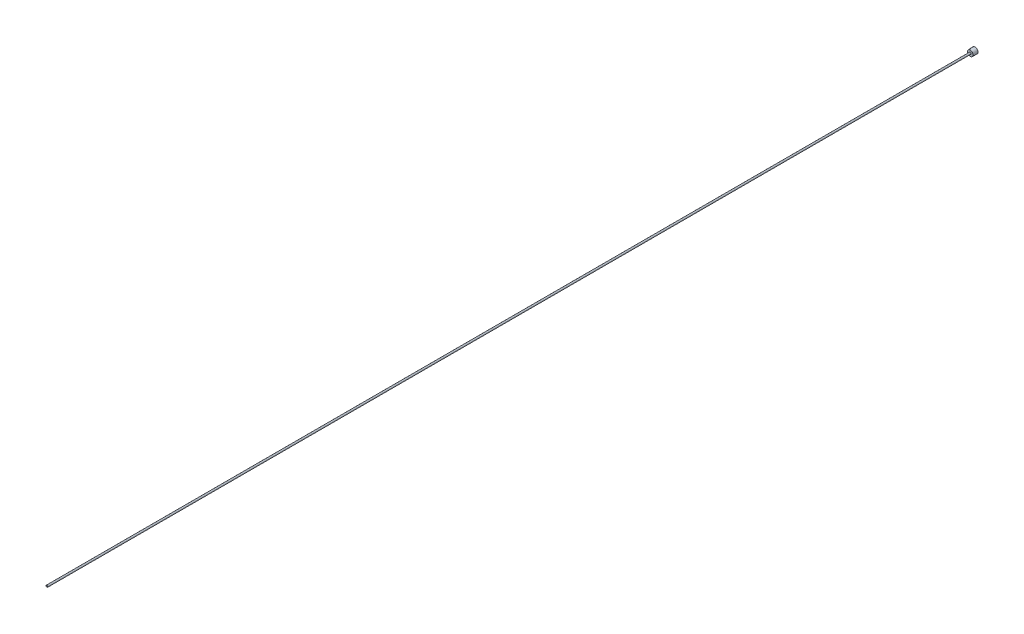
from build123d import *

# Parameters (mm, degrees)
SKETCH2_R          = 0.9652
CUT_EXTRUDE1_DEPTH = 1220.212468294
CUT_EXTRUDE2_DEPTH = 3.96875


with BuildPart() as part:
    # Sketch1 → Revolve1 (revolve)
    with BuildSketch(Plane(origin=(0, 0, 0), x_dir=(0, 0, -1), z_dir=(1, 0, 0)), mode=Mode.PRIVATE) as revolve1_sk:
        Polygon((-1219.2, 0), (0, 0), (0, 3.8989), (-6.35, 3.667387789), (-6.35, 1.143), (-1219.2, 1.143), align=None)
    revolve(revolve1_sk.sketch.rotate(Axis((0, 0, 0), (0, 0, -1)), 90), axis=Axis((0, 0, 0), (0, 0, -1)))

    # Sketch2 → Cut-Extrude1 (cut, through all)
    with BuildSketch(Plane.XY.offset(1219.2)):
        Circle(SKETCH2_R)
    extrude(amount=-CUT_EXTRUDE1_DEPTH, mode=Mode.SUBTRACT)

    # Sketch3 → Cut-Extrude2 (cut)
    with BuildSketch(Plane(origin=(0, 0, 0), x_dir=(-1, 0, 0), z_dir=(0, 0, -1))):
        Polygon((2.38125, -1.374815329), (2.38125, 1.374815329), (0, 2.749630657), (-2.38125, 1.374815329), (-2.38125, -1.374815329), (0, -2.749630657), align=None)
    extrude(amount=-CUT_EXTRUDE2_DEPTH, mode=Mode.SUBTRACT)


solid = part.part
